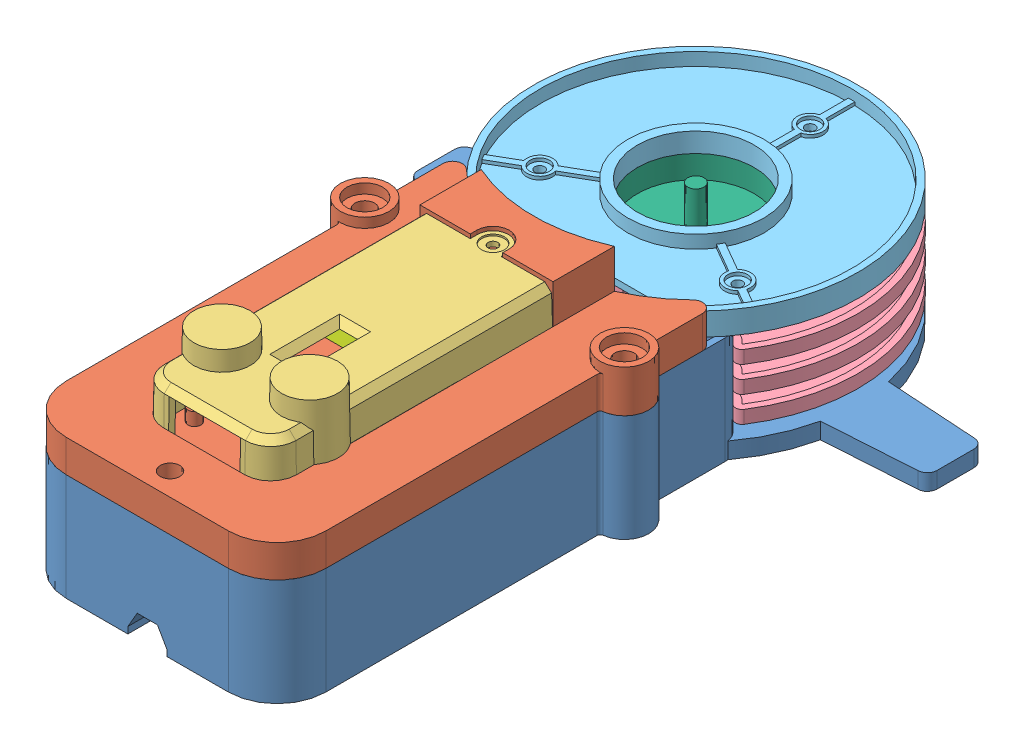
SolidWorks assembly RDM - Base.sldasm, configuration Predeterminado (file format 6000). Lengths in mm.
Overall size (160 62.16 219).
12 component instances, 7 part files, 0 mates.
Components (placement in the parent):
- RMD - Base pilas-1: RMD - Base pilas.sldprt [Predeterminado] at origin size (160 34 219)
- RDM - Tapa pilas-1: RDM - Tapa pilas.sldprt [Predeterminado] at (0 33 0) size (95 22 134.05)
- RDM - Tapa control-1: RDM - Tapa control.sldprt [Predeterminado] at (0 39 151.5) size (44.86 21 93.77)
- RDM - Anillo M1-1: RDM - Anillo M1.sldprt [Predeterminado] at (0 11 0) size (100 8 80)
- RDM - Placa base M1-1: RDM - Placa base M1.sldprt [Predeterminado] at (0 40 0) x (-1 0 0) z (0 0 1) size (100 11 89)
- RDM - Motor-1: RDM - Motor.sldprt [Predeterminado] at (0 34 0) x (0 0 1) z (0 1 0) size (40 59 39)
- RDM - Pila-1: RDM - Pila.sldprt [Predeterminado] at (-17.8357 18.5 37) x (0.954826 -0.297166 0) z (-0.297166 -0.954826 0) size (33 61 33)
- RDM - Anillo M1-2: RDM - Anillo M1.sldprt [Predeterminado] at (0 19 0) size (100 8 80)
- RDM - Anillo M1-3: RDM - Anillo M1.sldprt [Predeterminado] at (0 27 0) size (100 8 80)
- RDM - Pila-2: RDM - Pila.sldprt [Predeterminado] at (-17.8357 18.5 98) x (0.954826 -0.297166 0) z (-0.297166 -0.954826 0) size (33 61 33)
- RDM - Pila-3: RDM - Pila.sldprt [Predeterminado] at (17.8357 18.5 98) x (-0.954826 -0.297166 0) z (0.297166 -0.954826 0) size (33 61 33)
- RDM - Pila-4: RDM - Pila.sldprt [Predeterminado] at (17.8357 18.5 159) x (-0.954826 -0.297166 0) z (0.297166 -0.954826 0) size (33 61 33)
